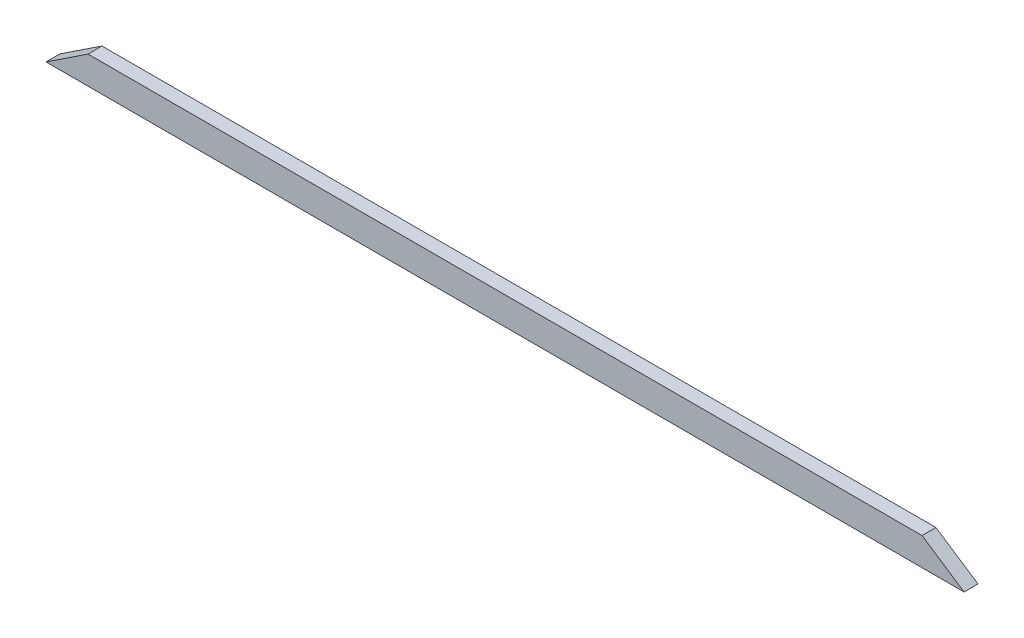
from build123d import *

# Parameters (mm, degrees)
EXTRUSION1_DEPTH = 5


with BuildPart() as part:
    # Esquisse1 → Extrusion1 (new body)
    with BuildSketch(Plane.XY):
        Polygon((317.785206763, 0), (302.671124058, 10), (2.899289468, 10), (-12.214793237, 0), align=None)
    extrude(amount=EXTRUSION1_DEPTH)


solid = part.part
